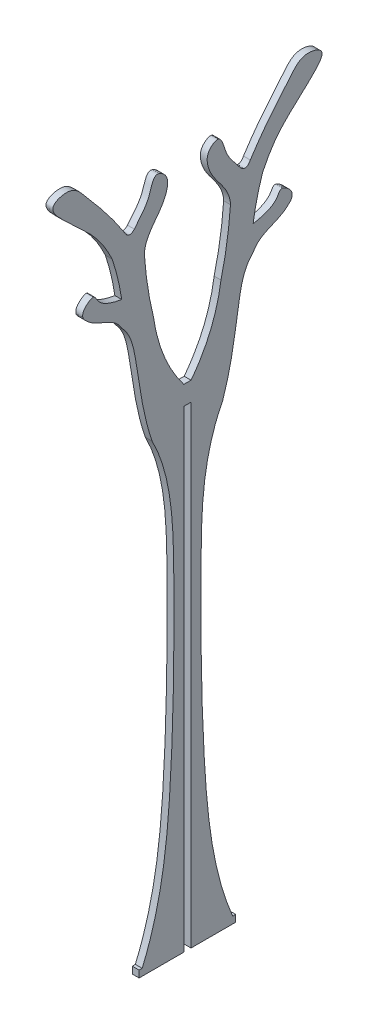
ISO-10303-21;
HEADER;
FILE_DESCRIPTION(('STEP AP214'),'2;1');
FILE_NAME('part.step','',(''),(''),'','','');
FILE_SCHEMA(('AUTOMOTIVE_DESIGN { 1 0 10303 214 1 1 1 1 }'));
ENDSEC;
DATA;
#1=APPLICATION_CONTEXT('core data for automotive mechanical design processes');
#2=APPLICATION_PROTOCOL_DEFINITION('international standard','automotive_design',2000,#1);
#3=PRODUCT_CONTEXT('',#1,'mechanical');
#4=PRODUCT('Part','Part','',(#3));
#5=PRODUCT_RELATED_PRODUCT_CATEGORY('part','',(#4));
#6=PRODUCT_DEFINITION_FORMATION('','',#4);
#7=PRODUCT_DEFINITION_CONTEXT('part definition',#1,'design');
#8=PRODUCT_DEFINITION('design','',#6,#7);
#9=PRODUCT_DEFINITION_SHAPE('','',#8);
#10=(LENGTH_UNIT() NAMED_UNIT(*) SI_UNIT(.MILLI.,.METRE.));
#11=(NAMED_UNIT(*) PLANE_ANGLE_UNIT() SI_UNIT($,.RADIAN.));
#12=(NAMED_UNIT(*) SI_UNIT($,.STERADIAN.) SOLID_ANGLE_UNIT());
#13=UNCERTAINTY_MEASURE_WITH_UNIT(LENGTH_MEASURE(1.E-05),#10,'distance_accuracy_value','');
#14=(GEOMETRIC_REPRESENTATION_CONTEXT(3) GLOBAL_UNCERTAINTY_ASSIGNED_CONTEXT((#13)) GLOBAL_UNIT_ASSIGNED_CONTEXT((#10,
#11,#12)) REPRESENTATION_CONTEXT('',''));
#15=CARTESIAN_POINT('',(0.,0.,0.));
#16=DIRECTION('',(0.,0.,1.));
#17=DIRECTION('',(1.,0.,0.));
#18=AXIS2_PLACEMENT_3D('',#15,#16,#17);
#19=CARTESIAN_POINT('',(18.,-102.065063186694,348.327513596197));
#20=DIRECTION('',(0.,-1.,2.81755677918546E-12));
#21=DIRECTION('',(0.,-2.81755677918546E-12,-1.));
#22=AXIS2_PLACEMENT_3D('',#19,#20,#21);
#23=PLANE('',#22);
#24=DIRECTION('',(0.,2.81755677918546E-12,1.));
#25=VECTOR('',#24,1.);
#26=CARTESIAN_POINT('',(0.,-102.065063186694,348.327513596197));
#27=LINE('',#26,#25);
#28=CARTESIAN_POINT('',(0.,-102.065063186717,340.328552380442));
#29=VERTEX_POINT('',#28);
#30=CARTESIAN_POINT('',(0.,-102.065063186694,348.327513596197));
#31=VERTEX_POINT('',#30);
#32=EDGE_CURVE('E260',#29,#31,#27,.T.);
#33=ORIENTED_EDGE('',*,*,#32,.T.);
#34=DIRECTION('',(-1.,0.,0.));
#35=VECTOR('',#34,1.);
#36=CARTESIAN_POINT('',(18.,-102.065063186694,348.327513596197));
#37=LINE('',#36,#35);
#38=CARTESIAN_POINT('',(18.,-102.065063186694,348.327513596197));
#39=VERTEX_POINT('',#38);
#40=EDGE_CURVE('E11',#39,#31,#37,.T.);
#41=ORIENTED_EDGE('',*,*,#40,.F.);
#42=DIRECTION('',(0.,2.81755677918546E-12,1.));
#43=VECTOR('',#42,1.);
#44=CARTESIAN_POINT('',(18.,-102.065063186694,348.327513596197));
#45=LINE('',#44,#43);
#46=CARTESIAN_POINT('',(18.,-102.065063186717,340.328552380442));
#47=VERTEX_POINT('',#46);
#48=EDGE_CURVE('E418',#47,#39,#45,.T.);
#49=ORIENTED_EDGE('',*,*,#48,.F.);
#50=DIRECTION('',(-1.,0.,0.));
#51=VECTOR('',#50,1.);
#52=CARTESIAN_POINT('',(18.,-102.065063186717,340.328552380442));
#53=LINE('',#52,#51);
#54=EDGE_CURVE('E256',#47,#29,#53,.T.);
#55=ORIENTED_EDGE('',*,*,#54,.T.);
#56=EDGE_LOOP('',(#33,#41,#49,#55));
#57=FACE_BOUND('',#56,.T.);
#58=ADVANCED_FACE('F32',(#57),#23,.F.);
#59=CARTESIAN_POINT('',(18.,-102.065063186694,348.327513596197));
#60=CARTESIAN_POINT('',(18.,-50.3471989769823,370.406574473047));
#61=CARTESIAN_POINT('',(18.,77.3533615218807,406.758439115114));
#62=CARTESIAN_POINT('',(18.,362.214519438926,430.841066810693));
#63=CARTESIAN_POINT('',(18.,703.166417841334,433.488963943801));
#64=CARTESIAN_POINT('',(18.,980.40872740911,428.763865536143));
#65=CARTESIAN_POINT('',(18.,1085.29034068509,374.416732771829));
#66=B_SPLINE_CURVE_WITH_KNOTS('',3,(#59,#60,#61,#62,#63,#64,#65),.UNSPECIFIED.,.F.,.F.,(4,1,1,1,
4),(0.,0.136622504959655,0.325866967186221,0.696865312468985,0.984083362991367),.UNSPECIFIED.);
#67=DIRECTION('',(-1.,0.,0.));
#68=VECTOR('',#67,1.);
#69=SURFACE_OF_LINEAR_EXTRUSION('',#66,#68);
#70=CARTESIAN_POINT('',(0.,-102.065063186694,348.327513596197));
#71=CARTESIAN_POINT('',(0.,-50.3471989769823,370.406574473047));
#72=CARTESIAN_POINT('',(0.,77.3533615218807,406.758439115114));
#73=CARTESIAN_POINT('',(0.,362.214519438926,430.841066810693));
#74=CARTESIAN_POINT('',(0.,703.166417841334,433.488963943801));
#75=CARTESIAN_POINT('',(0.,980.40872740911,428.763865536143));
#76=CARTESIAN_POINT('',(0.,1085.29034068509,374.416732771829));
#77=B_SPLINE_CURVE_WITH_KNOTS('',3,(#70,#71,#72,#73,#74,#75,#76),.UNSPECIFIED.,.F.,.F.,(4,1,1,1,
4),(0.,0.136622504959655,0.325866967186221,0.696865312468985,0.984083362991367),.UNSPECIFIED.);
#78=CARTESIAN_POINT('',(0.,1085.29034068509,374.416732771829));
#79=VERTEX_POINT('',#78);
#80=EDGE_CURVE('E263',#31,#79,#77,.T.);
#81=ORIENTED_EDGE('',*,*,#80,.T.);
#82=DIRECTION('',(-1.,0.,0.));
#83=VECTOR('',#82,1.);
#84=CARTESIAN_POINT('',(18.,1085.29034068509,374.416732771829));
#85=LINE('',#84,#83);
#86=CARTESIAN_POINT('',(18.,1085.29034068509,374.416732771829));
#87=VERTEX_POINT('',#86);
#88=EDGE_CURVE('E40',#87,#79,#85,.T.);
#89=ORIENTED_EDGE('',*,*,#88,.F.);
#90=EDGE_CURVE('E157',#39,#87,#66,.T.);
#91=ORIENTED_EDGE('',*,*,#90,.F.);
#92=ORIENTED_EDGE('',*,*,#40,.T.);
#93=EDGE_LOOP('',(#81,#89,#91,#92));
#94=FACE_BOUND('',#93,.T.);
#95=ADVANCED_FACE('F545',(#94),#69,.F.);
#96=CARTESIAN_POINT('',(18.,1085.29034068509,374.416732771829));
#97=CARTESIAN_POINT('',(18.,1122.39012110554,361.752567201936));
#98=CARTESIAN_POINT('',(18.,1194.30701632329,345.048249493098));
#99=CARTESIAN_POINT('',(18.,1296.67266670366,332.104046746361));
#100=CARTESIAN_POINT('',(18.,1359.36695551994,317.215444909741));
#101=CARTESIAN_POINT('',(18.,1382.19578894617,294.569377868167));
#102=B_SPLINE_CURVE_WITH_KNOTS('',3,(#96,#97,#98,#99,#100,#101),.UNSPECIFIED.,.F.,.F.,(4,1,1,4),
(0.,0.379260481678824,0.713287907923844,1.),.UNSPECIFIED.);
#103=DIRECTION('',(-1.,0.,0.));
#104=VECTOR('',#103,1.);
#105=SURFACE_OF_LINEAR_EXTRUSION('',#102,#104);
#106=CARTESIAN_POINT('',(0.,1085.29034068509,374.416732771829));
#107=CARTESIAN_POINT('',(0.,1122.39012110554,361.752567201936));
#108=CARTESIAN_POINT('',(0.,1194.30701632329,345.048249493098));
#109=CARTESIAN_POINT('',(0.,1296.67266670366,332.104046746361));
#110=CARTESIAN_POINT('',(0.,1359.36695551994,317.215444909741));
#111=CARTESIAN_POINT('',(0.,1382.19578894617,294.569377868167));
#112=B_SPLINE_CURVE_WITH_KNOTS('',3,(#106,#107,#108,#109,#110,#111),.UNSPECIFIED.,.F.,.F.,(4,1,
1,4),(0.,0.379260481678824,0.713287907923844,1.),.UNSPECIFIED.);
#113=CARTESIAN_POINT('',(0.,1382.19578894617,294.569377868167));
#114=VERTEX_POINT('',#113);
#115=EDGE_CURVE('E267',#79,#114,#112,.T.);
#116=ORIENTED_EDGE('',*,*,#115,.T.);
#117=DIRECTION('',(-1.,0.,0.));
#118=VECTOR('',#117,1.);
#119=CARTESIAN_POINT('',(18.,1382.19578894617,294.569377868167));
#120=LINE('',#119,#118);
#121=CARTESIAN_POINT('',(18.,1382.19578894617,294.569377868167));
#122=VERTEX_POINT('',#121);
#123=EDGE_CURVE('E491',#122,#114,#120,.T.);
#124=ORIENTED_EDGE('',*,*,#123,.F.);
#125=EDGE_CURVE('E499',#87,#122,#102,.T.);
#126=ORIENTED_EDGE('',*,*,#125,.F.);
#127=ORIENTED_EDGE('',*,*,#88,.T.);
#128=EDGE_LOOP('',(#116,#124,#126,#127));
#129=FACE_BOUND('',#128,.T.);
#130=ADVANCED_FACE('F497',(#129),#105,.F.);
#131=CARTESIAN_POINT('',(18.,1382.19578894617,294.569377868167));
#132=CARTESIAN_POINT('',(18.,1418.99586689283,275.310990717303));
#133=CARTESIAN_POINT('',(18.,1417.17916799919,228.746989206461));
#134=CARTESIAN_POINT('',(18.,1445.09122585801,201.939813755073));
#135=B_SPLINE_CURVE_WITH_KNOTS('',3,(#131,#132,#133,#134),.UNSPECIFIED.,.F.,.F.,(4,4),(0.,1.),.UNSPECIFIED.);
#136=DIRECTION('',(-1.,0.,0.));
#137=VECTOR('',#136,1.);
#138=SURFACE_OF_LINEAR_EXTRUSION('',#135,#137);
#139=CARTESIAN_POINT('',(0.,1382.19578894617,294.569377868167));
#140=CARTESIAN_POINT('',(0.,1418.99586689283,275.310990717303));
#141=CARTESIAN_POINT('',(0.,1417.17916799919,228.746989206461));
#142=CARTESIAN_POINT('',(0.,1445.09122585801,201.939813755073));
#143=B_SPLINE_CURVE_WITH_KNOTS('',3,(#139,#140,#141,#142),.UNSPECIFIED.,.F.,.F.,(4,4),(0.,1.),.UNSPECIFIED.);
#144=CARTESIAN_POINT('',(0.,1445.09122585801,201.939813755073));
#145=VERTEX_POINT('',#144);
#146=EDGE_CURVE('E274',#114,#145,#143,.T.);
#147=ORIENTED_EDGE('',*,*,#146,.T.);
#148=DIRECTION('',(-1.,0.,0.));
#149=VECTOR('',#148,1.);
#150=CARTESIAN_POINT('',(18.,1445.09122585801,201.939813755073));
#151=LINE('',#150,#149);
#152=CARTESIAN_POINT('',(18.,1445.09122585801,201.939813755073));
#153=VERTEX_POINT('',#152);
#154=EDGE_CURVE('E488',#153,#145,#151,.T.);
#155=ORIENTED_EDGE('',*,*,#154,.F.);
#156=EDGE_CURVE('E517',#122,#153,#135,.T.);
#157=ORIENTED_EDGE('',*,*,#156,.F.);
#158=ORIENTED_EDGE('',*,*,#123,.T.);
#159=EDGE_LOOP('',(#147,#155,#157,#158));
#160=FACE_BOUND('',#159,.T.);
#161=ADVANCED_FACE('F508',(#160),#138,.F.);
#162=CARTESIAN_POINT('',(18.,1445.09122585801,201.939813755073));
#163=CARTESIAN_POINT('',(18.,1459.20417597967,182.916466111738));
#164=CARTESIAN_POINT('',(18.,1480.59158930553,195.762265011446));
#165=CARTESIAN_POINT('',(18.,1493.51988707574,223.101636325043));
#166=CARTESIAN_POINT('',(18.,1475.0719689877,230.565968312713));
#167=CARTESIAN_POINT('',(18.,1456.4606147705,252.114591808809));
#168=CARTESIAN_POINT('',(18.,1450.45765615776,277.468960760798));
#169=CARTESIAN_POINT('',(18.,1447.52556976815,294.569377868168));
#170=B_SPLINE_CURVE_WITH_KNOTS('',3,(#162,#163,#164,#165,#166,#167,#168,#169),.UNSPECIFIED.,.F.,
.F.,(4,1,1,1,1,4),(0.,0.336795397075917,0.409108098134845,0.52118844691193,0.643455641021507,
1.),.UNSPECIFIED.);
#171=DIRECTION('',(-1.,0.,0.));
#172=VECTOR('',#171,1.);
#173=SURFACE_OF_LINEAR_EXTRUSION('',#170,#172);
#174=CARTESIAN_POINT('',(0.,1445.09122585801,201.939813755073));
#175=CARTESIAN_POINT('',(0.,1459.20417597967,182.916466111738));
#176=CARTESIAN_POINT('',(0.,1480.59158930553,195.762265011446));
#177=CARTESIAN_POINT('',(0.,1493.51988707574,223.101636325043));
#178=CARTESIAN_POINT('',(0.,1475.0719689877,230.565968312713));
#179=CARTESIAN_POINT('',(0.,1456.4606147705,252.114591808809));
#180=CARTESIAN_POINT('',(0.,1450.45765615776,277.468960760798));
#181=CARTESIAN_POINT('',(0.,1447.52556976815,294.569377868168));
#182=B_SPLINE_CURVE_WITH_KNOTS('',3,(#174,#175,#176,#177,#178,#179,#180,#181),.UNSPECIFIED.,.F.,
.F.,(4,1,1,1,1,4),(0.,0.336795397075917,0.409108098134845,0.52118844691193,0.643455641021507,
1.),.UNSPECIFIED.);
#183=CARTESIAN_POINT('',(0.,1447.52556976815,294.569377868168));
#184=VERTEX_POINT('',#183);
#185=EDGE_CURVE('E281',#145,#184,#182,.T.);
#186=ORIENTED_EDGE('',*,*,#185,.T.);
#187=DIRECTION('',(-1.,0.,0.));
#188=VECTOR('',#187,1.);
#189=CARTESIAN_POINT('',(18.,1447.52556976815,294.569377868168));
#190=LINE('',#189,#188);
#191=CARTESIAN_POINT('',(18.,1447.52556976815,294.569377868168));
#192=VERTEX_POINT('',#191);
#193=EDGE_CURVE('E485',#192,#184,#190,.T.);
#194=ORIENTED_EDGE('',*,*,#193,.F.);
#195=EDGE_CURVE('E514',#153,#192,#170,.T.);
#196=ORIENTED_EDGE('',*,*,#195,.F.);
#197=ORIENTED_EDGE('',*,*,#154,.T.);
#198=EDGE_LOOP('',(#186,#194,#196,#197));
#199=FACE_BOUND('',#198,.T.);
#200=ADVANCED_FACE('F512',(#199),#173,.F.);
#201=CARTESIAN_POINT('',(18.,1447.52556976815,294.569377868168));
#202=CARTESIAN_POINT('',(18.,1500.79321353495,286.733849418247));
#203=CARTESIAN_POINT('',(18.,1551.90531483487,269.555985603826));
#204=B_SPLINE_CURVE_WITH_KNOTS('',2,(#201,#202,#203),.UNSPECIFIED.,.F.,.F.,(3,3),(0.,1.),.UNSPECIFIED.);
#205=DIRECTION('',(-1.,0.,0.));
#206=VECTOR('',#205,1.);
#207=SURFACE_OF_LINEAR_EXTRUSION('',#204,#206);
#208=CARTESIAN_POINT('',(0.,1447.52556976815,294.569377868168));
#209=CARTESIAN_POINT('',(0.,1500.79321353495,286.733849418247));
#210=CARTESIAN_POINT('',(0.,1551.90531483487,269.555985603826));
#211=B_SPLINE_CURVE_WITH_KNOTS('',2,(#208,#209,#210),.UNSPECIFIED.,.F.,.F.,(3,3),(0.,1.),.UNSPECIFIED.);
#212=CARTESIAN_POINT('',(0.,1551.90531483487,269.555985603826));
#213=VERTEX_POINT('',#212);
#214=EDGE_CURVE('E288',#184,#213,#211,.T.);
#215=ORIENTED_EDGE('',*,*,#214,.T.);
#216=DIRECTION('',(-1.,0.,0.));
#217=VECTOR('',#216,1.);
#218=CARTESIAN_POINT('',(18.,1551.90531483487,269.555985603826));
#219=LINE('',#218,#217);
#220=CARTESIAN_POINT('',(18.,1551.90531483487,269.555985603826));
#221=VERTEX_POINT('',#220);
#222=EDGE_CURVE('E482',#221,#213,#219,.T.);
#223=ORIENTED_EDGE('',*,*,#222,.F.);
#224=EDGE_CURVE('E516',#192,#221,#204,.T.);
#225=ORIENTED_EDGE('',*,*,#224,.F.);
#226=ORIENTED_EDGE('',*,*,#193,.T.);
#227=EDGE_LOOP('',(#215,#223,#225,#226));
#228=FACE_BOUND('',#227,.T.);
#229=ADVANCED_FACE('F540',(#228),#207,.F.);
#230=CARTESIAN_POINT('',(18.,1551.90531483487,269.555985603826));
#231=CARTESIAN_POINT('',(18.,1630.14427168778,232.350307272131));
#232=CARTESIAN_POINT('',(18.,1651.42055410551,191.889125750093));
#233=CARTESIAN_POINT('',(18.,1752.33880535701,94.3066784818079));
#234=CARTESIAN_POINT('',(18.,1769.3588344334,154.29066282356));
#235=CARTESIAN_POINT('',(18.,1751.89031157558,181.75675813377));
#236=CARTESIAN_POINT('',(18.,1720.87794995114,205.90726024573));
#237=CARTESIAN_POINT('',(18.,1672.39537245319,249.189179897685));
#238=CARTESIAN_POINT('',(18.,1625.94983213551,282.701001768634));
#239=CARTESIAN_POINT('',(18.,1596.3007384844,301.940349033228));
#240=B_SPLINE_CURVE_WITH_KNOTS('',3,(#230,#231,#232,#233,#234,#235,#236,#237,#238,#239),
.UNSPECIFIED.,.F.,.F.,(4,1,1,1,1,1,1,4),(0.,0.385763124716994,0.485334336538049,
0.571206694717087,0.624037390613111,0.671733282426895,0.795732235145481,1.),.UNSPECIFIED.);
#241=DIRECTION('',(-1.,0.,0.));
#242=VECTOR('',#241,1.);
#243=SURFACE_OF_LINEAR_EXTRUSION('',#240,#242);
#244=CARTESIAN_POINT('',(0.,1551.90531483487,269.555985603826));
#245=CARTESIAN_POINT('',(0.,1630.14427168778,232.350307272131));
#246=CARTESIAN_POINT('',(0.,1651.42055410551,191.889125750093));
#247=CARTESIAN_POINT('',(0.,1752.33880535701,94.3066784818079));
#248=CARTESIAN_POINT('',(0.,1769.3588344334,154.29066282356));
#249=CARTESIAN_POINT('',(0.,1751.89031157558,181.75675813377));
#250=CARTESIAN_POINT('',(0.,1720.87794995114,205.90726024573));
#251=CARTESIAN_POINT('',(0.,1672.39537245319,249.189179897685));
#252=CARTESIAN_POINT('',(0.,1625.94983213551,282.701001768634));
#253=CARTESIAN_POINT('',(0.,1596.3007384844,301.940349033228));
#254=B_SPLINE_CURVE_WITH_KNOTS('',3,(#244,#245,#246,#247,#248,#249,#250,#251,#252,#253),
.UNSPECIFIED.,.F.,.F.,(4,1,1,1,1,1,1,4),(0.,0.385763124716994,0.485334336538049,
0.571206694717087,0.624037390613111,0.671733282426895,0.795732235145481,1.),.UNSPECIFIED.);
#255=CARTESIAN_POINT('',(0.,1596.3007384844,301.940349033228));
#256=VERTEX_POINT('',#255);
#257=EDGE_CURVE('E295',#213,#256,#254,.T.);
#258=ORIENTED_EDGE('',*,*,#257,.T.);
#259=DIRECTION('',(-1.,0.,0.));
#260=VECTOR('',#259,1.);
#261=CARTESIAN_POINT('',(18.,1596.3007384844,301.940349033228));
#262=LINE('',#261,#260);
#263=CARTESIAN_POINT('',(18.,1596.3007384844,301.940349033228));
#264=VERTEX_POINT('',#263);
#265=EDGE_CURVE('E479',#264,#256,#262,.T.);
#266=ORIENTED_EDGE('',*,*,#265,.F.);
#267=EDGE_CURVE('E519',#221,#264,#240,.T.);
#268=ORIENTED_EDGE('',*,*,#267,.F.);
#269=ORIENTED_EDGE('',*,*,#222,.T.);
#270=EDGE_LOOP('',(#258,#266,#268,#269));
#271=FACE_BOUND('',#270,.T.);
#272=ADVANCED_FACE('F600',(#271),#243,.F.);
#273=CARTESIAN_POINT('',(18.,1596.3007384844,301.940349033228));
#274=CARTESIAN_POINT('',(18.,1576.2379498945,312.750016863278));
#275=CARTESIAN_POINT('',(18.,1591.22762554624,327.745318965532));
#276=B_SPLINE_CURVE_WITH_KNOTS('',2,(#273,#274,#275),.UNSPECIFIED.,.F.,.F.,(3,3),(0.,1.),.UNSPECIFIED.);
#277=DIRECTION('',(-1.,0.,0.));
#278=VECTOR('',#277,1.);
#279=SURFACE_OF_LINEAR_EXTRUSION('',#276,#278);
#280=CARTESIAN_POINT('',(0.,1596.3007384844,301.940349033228));
#281=CARTESIAN_POINT('',(0.,1576.2379498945,312.750016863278));
#282=CARTESIAN_POINT('',(0.,1591.22762554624,327.745318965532));
#283=B_SPLINE_CURVE_WITH_KNOTS('',2,(#280,#281,#282),.UNSPECIFIED.,.F.,.F.,(3,3),(0.,1.),.UNSPECIFIED.);
#284=CARTESIAN_POINT('',(0.,1591.22762554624,327.745318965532));
#285=VERTEX_POINT('',#284);
#286=EDGE_CURVE('E302',#256,#285,#283,.T.);
#287=ORIENTED_EDGE('',*,*,#286,.T.);
#288=DIRECTION('',(-1.,0.,0.));
#289=VECTOR('',#288,1.);
#290=CARTESIAN_POINT('',(18.,1591.22762554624,327.745318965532));
#291=LINE('',#290,#289);
#292=CARTESIAN_POINT('',(18.,1591.22762554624,327.745318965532));
#293=VERTEX_POINT('',#292);
#294=EDGE_CURVE('E476',#293,#285,#291,.T.);
#295=ORIENTED_EDGE('',*,*,#294,.F.);
#296=EDGE_CURVE('E945',#264,#293,#276,.T.);
#297=ORIENTED_EDGE('',*,*,#296,.F.);
#298=ORIENTED_EDGE('',*,*,#265,.T.);
#299=EDGE_LOOP('',(#287,#295,#297,#298));
#300=FACE_BOUND('',#299,.T.);
#301=ADVANCED_FACE('F609',(#300),#279,.F.);
#302=CARTESIAN_POINT('',(18.,1591.22762554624,327.745318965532));
#303=CARTESIAN_POINT('',(18.,1619.17927999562,349.424359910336));
#304=CARTESIAN_POINT('',(18.,1632.74059074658,365.07903383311));
#305=CARTESIAN_POINT('',(18.,1696.40785667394,380.115557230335));
#306=CARTESIAN_POINT('',(18.,1672.97152257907,415.375831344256));
#307=CARTESIAN_POINT('',(18.,1648.96332136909,416.129467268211));
#308=CARTESIAN_POINT('',(18.,1628.39450218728,410.70244728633));
#309=CARTESIAN_POINT('',(18.,1601.98611846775,398.088276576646));
#310=CARTESIAN_POINT('',(18.,1570.58418902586,369.94017482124));
#311=CARTESIAN_POINT('',(18.,1538.73634635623,354.52061175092));
#312=CARTESIAN_POINT('',(18.,1520.55759534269,354.085962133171));
#313=B_SPLINE_CURVE_WITH_KNOTS('',3,(#302,#303,#304,#305,#306,#307,#308,#309,#310,#311,#312),
.UNSPECIFIED.,.F.,.F.,(4,1,1,1,1,1,1,1,4),(0.,0.252302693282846,0.363690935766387,
0.456026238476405,0.541932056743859,0.588618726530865,0.664111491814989,0.825410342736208,1.),.UNSPECIFIED.);
#314=DIRECTION('',(-1.,0.,0.));
#315=VECTOR('',#314,1.);
#316=SURFACE_OF_LINEAR_EXTRUSION('',#313,#315);
#317=CARTESIAN_POINT('',(0.,1591.22762554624,327.745318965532));
#318=CARTESIAN_POINT('',(0.,1619.17927999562,349.424359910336));
#319=CARTESIAN_POINT('',(0.,1632.74059074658,365.07903383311));
#320=CARTESIAN_POINT('',(0.,1696.40785667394,380.115557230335));
#321=CARTESIAN_POINT('',(0.,1672.97152257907,415.375831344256));
#322=CARTESIAN_POINT('',(0.,1648.96332136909,416.129467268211));
#323=CARTESIAN_POINT('',(0.,1628.39450218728,410.70244728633));
#324=CARTESIAN_POINT('',(0.,1601.98611846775,398.088276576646));
#325=CARTESIAN_POINT('',(0.,1570.58418902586,369.94017482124));
#326=CARTESIAN_POINT('',(0.,1538.73634635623,354.52061175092));
#327=CARTESIAN_POINT('',(0.,1520.55759534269,354.085962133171));
#328=B_SPLINE_CURVE_WITH_KNOTS('',3,(#317,#318,#319,#320,#321,#322,#323,#324,#325,#326,#327),
.UNSPECIFIED.,.F.,.F.,(4,1,1,1,1,1,1,1,4),(0.,0.252302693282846,0.363690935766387,
0.456026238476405,0.541932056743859,0.588618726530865,0.664111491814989,0.825410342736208,1.),.UNSPECIFIED.);
#329=CARTESIAN_POINT('',(0.,1520.55759534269,354.085962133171));
#330=VERTEX_POINT('',#329);
#331=EDGE_CURVE('E309',#285,#330,#328,.T.);
#332=ORIENTED_EDGE('',*,*,#331,.T.);
#333=DIRECTION('',(-1.,0.,0.));
#334=VECTOR('',#333,1.);
#335=CARTESIAN_POINT('',(18.,1520.55759534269,354.085962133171));
#336=LINE('',#335,#334);
#337=CARTESIAN_POINT('',(18.,1520.55759534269,354.085962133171));
#338=VERTEX_POINT('',#337);
#339=EDGE_CURVE('E473',#338,#330,#336,.T.);
#340=ORIENTED_EDGE('',*,*,#339,.F.);
#341=EDGE_CURVE('E942',#293,#338,#313,.T.);
#342=ORIENTED_EDGE('',*,*,#341,.F.);
#343=ORIENTED_EDGE('',*,*,#294,.T.);
#344=EDGE_LOOP('',(#332,#340,#342,#343));
#345=FACE_BOUND('',#344,.T.);
#346=ADVANCED_FACE('F618',(#345),#316,.F.);
#347=CARTESIAN_POINT('',(18.,1520.55759534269,354.085962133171));
#348=CARTESIAN_POINT('',(18.,1440.05033038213,359.632506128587));
#349=CARTESIAN_POINT('',(18.,1361.52525284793,379.003516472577));
#350=B_SPLINE_CURVE_WITH_KNOTS('',2,(#347,#348,#349),.UNSPECIFIED.,.F.,.F.,(3,3),(0.,1.),.UNSPECIFIED.);
#351=DIRECTION('',(-1.,0.,0.));
#352=VECTOR('',#351,1.);
#353=SURFACE_OF_LINEAR_EXTRUSION('',#350,#352);
#354=CARTESIAN_POINT('',(0.,1520.55759534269,354.085962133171));
#355=CARTESIAN_POINT('',(0.,1440.05033038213,359.632506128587));
#356=CARTESIAN_POINT('',(0.,1361.52525284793,379.003516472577));
#357=B_SPLINE_CURVE_WITH_KNOTS('',2,(#354,#355,#356),.UNSPECIFIED.,.F.,.F.,(3,3),(0.,1.),.UNSPECIFIED.);
#358=CARTESIAN_POINT('',(0.,1361.52525284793,379.003516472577));
#359=VERTEX_POINT('',#358);
#360=EDGE_CURVE('E316',#330,#359,#357,.T.);
#361=ORIENTED_EDGE('',*,*,#360,.T.);
#362=DIRECTION('',(-1.,0.,0.));
#363=VECTOR('',#362,1.);
#364=CARTESIAN_POINT('',(18.,1361.52525284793,379.003516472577));
#365=LINE('',#364,#363);
#366=CARTESIAN_POINT('',(18.,1361.52525284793,379.003516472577));
#367=VERTEX_POINT('',#366);
#368=EDGE_CURVE('E470',#367,#359,#365,.T.);
#369=ORIENTED_EDGE('',*,*,#368,.F.);
#370=EDGE_CURVE('E940',#338,#367,#350,.T.);
#371=ORIENTED_EDGE('',*,*,#370,.F.);
#372=ORIENTED_EDGE('',*,*,#339,.T.);
#373=EDGE_LOOP('',(#361,#369,#371,#372));
#374=FACE_BOUND('',#373,.T.);
#375=ADVANCED_FACE('F628',(#374),#353,.F.);
#376=CARTESIAN_POINT('',(18.,1361.52525284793,379.003516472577));
#377=CARTESIAN_POINT('',(18.,1255.1269074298,394.540775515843));
#378=CARTESIAN_POINT('',(18.,1172.78017855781,457.786070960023));
#379=B_SPLINE_CURVE_WITH_KNOTS('',2,(#376,#377,#378),.UNSPECIFIED.,.F.,.F.,(3,3),(0.,1.),.UNSPECIFIED.);
#380=DIRECTION('',(-1.,0.,0.));
#381=VECTOR('',#380,1.);
#382=SURFACE_OF_LINEAR_EXTRUSION('',#379,#381);
#383=CARTESIAN_POINT('',(0.,1361.52525284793,379.003516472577));
#384=CARTESIAN_POINT('',(0.,1255.1269074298,394.540775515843));
#385=CARTESIAN_POINT('',(0.,1172.78017855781,457.786070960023));
#386=B_SPLINE_CURVE_WITH_KNOTS('',2,(#383,#384,#385),.UNSPECIFIED.,.F.,.F.,(3,3),(0.,1.),.UNSPECIFIED.);
#387=CARTESIAN_POINT('',(0.,1172.78017855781,457.786070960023));
#388=VERTEX_POINT('',#387);
#389=EDGE_CURVE('E323',#359,#388,#386,.T.);
#390=ORIENTED_EDGE('',*,*,#389,.T.);
#391=DIRECTION('',(-1.,0.,0.));
#392=VECTOR('',#391,1.);
#393=CARTESIAN_POINT('',(18.,1172.78017855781,457.786070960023));
#394=LINE('',#393,#392);
#395=CARTESIAN_POINT('',(18.,1172.78017855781,457.786070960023));
#396=VERTEX_POINT('',#395);
#397=EDGE_CURVE('E467',#396,#388,#394,.T.);
#398=ORIENTED_EDGE('',*,*,#397,.F.);
#399=EDGE_CURVE('E933',#367,#396,#379,.T.);
#400=ORIENTED_EDGE('',*,*,#399,.F.);
#401=ORIENTED_EDGE('',*,*,#368,.T.);
#402=EDGE_LOOP('',(#390,#398,#400,#401));
#403=FACE_BOUND('',#402,.T.);
#404=ADVANCED_FACE('F638',(#403),#382,.F.);
#405=CARTESIAN_POINT('',(18.,1172.78017855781,457.786070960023));
#406=DIRECTION('',(0.,-1.,0.));
#407=DIRECTION('',(0.,0.,-1.));
#408=AXIS2_PLACEMENT_3D('',#405,#406,#407);
#409=PLANE('',#408);
#410=DIRECTION('',(0.,0.,1.));
#411=VECTOR('',#410,1.);
#412=CARTESIAN_POINT('',(0.,1172.78017855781,457.786070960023));
#413=LINE('',#412,#411);
#414=CARTESIAN_POINT('',(0.,1172.78017855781,476.786070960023));
#415=VERTEX_POINT('',#414);
#416=EDGE_CURVE('E330',#388,#415,#413,.T.);
#417=ORIENTED_EDGE('',*,*,#416,.T.);
#418=DIRECTION('',(-1.,0.,0.));
#419=VECTOR('',#418,1.);
#420=CARTESIAN_POINT('',(18.,1172.78017855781,476.786070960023));
#421=LINE('',#420,#419);
#422=CARTESIAN_POINT('',(18.,1172.78017855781,476.786070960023));
#423=VERTEX_POINT('',#422);
#424=EDGE_CURVE('E464',#423,#415,#421,.T.);
#425=ORIENTED_EDGE('',*,*,#424,.F.);
#426=DIRECTION('',(0.,0.,1.));
#427=VECTOR('',#426,1.);
#428=CARTESIAN_POINT('',(18.,1172.78017855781,457.786070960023));
#429=LINE('',#428,#427);
#430=EDGE_CURVE('E930',#396,#423,#429,.T.);
#431=ORIENTED_EDGE('',*,*,#430,.F.);
#432=ORIENTED_EDGE('',*,*,#397,.T.);
#433=EDGE_LOOP('',(#417,#425,#431,#432));
#434=FACE_BOUND('',#433,.T.);
#435=ADVANCED_FACE('F648',(#434),#409,.F.);
#436=CARTESIAN_POINT('',(18.,1172.78017855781,476.786070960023));
#437=CARTESIAN_POINT('',(18.,1255.1269074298,540.031366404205));
#438=CARTESIAN_POINT('',(18.,1361.52525284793,555.568625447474));
#439=B_SPLINE_CURVE_WITH_KNOTS('',2,(#436,#437,#438),.UNSPECIFIED.,.F.,.F.,(3,3),(0.,1.),.UNSPECIFIED.);
#440=DIRECTION('',(-1.,0.,0.));
#441=VECTOR('',#440,1.);
#442=SURFACE_OF_LINEAR_EXTRUSION('',#439,#441);
#443=CARTESIAN_POINT('',(0.,1172.78017855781,476.786070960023));
#444=CARTESIAN_POINT('',(0.,1255.1269074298,540.031366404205));
#445=CARTESIAN_POINT('',(0.,1361.52525284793,555.568625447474));
#446=B_SPLINE_CURVE_WITH_KNOTS('',2,(#443,#444,#445),.UNSPECIFIED.,.F.,.F.,(3,3),(0.,1.),.UNSPECIFIED.);
#447=CARTESIAN_POINT('',(0.,1361.52525284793,555.568625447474));
#448=VERTEX_POINT('',#447);
#449=EDGE_CURVE('E335',#415,#448,#446,.T.);
#450=ORIENTED_EDGE('',*,*,#449,.T.);
#451=DIRECTION('',(-1.,0.,0.));
#452=VECTOR('',#451,1.);
#453=CARTESIAN_POINT('',(18.,1361.52525284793,555.568625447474));
#454=LINE('',#453,#452);
#455=CARTESIAN_POINT('',(18.,1361.52525284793,555.568625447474));
#456=VERTEX_POINT('',#455);
#457=EDGE_CURVE('E461',#456,#448,#454,.T.);
#458=ORIENTED_EDGE('',*,*,#457,.F.);
#459=EDGE_CURVE('E928',#423,#456,#439,.T.);
#460=ORIENTED_EDGE('',*,*,#459,.F.);
#461=ORIENTED_EDGE('',*,*,#424,.T.);
#462=EDGE_LOOP('',(#450,#458,#460,#461));
#463=FACE_BOUND('',#462,.T.);
#464=ADVANCED_FACE('F658',(#463),#442,.F.);
#465=CARTESIAN_POINT('',(18.,1361.52525284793,555.568625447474));
#466=CARTESIAN_POINT('',(18.,1440.05033038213,574.939635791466));
#467=CARTESIAN_POINT('',(18.,1520.55759534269,580.486179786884));
#468=B_SPLINE_CURVE_WITH_KNOTS('',2,(#465,#466,#467),.UNSPECIFIED.,.F.,.F.,(3,3),(0.,1.),.UNSPECIFIED.);
#469=DIRECTION('',(-1.,0.,0.));
#470=VECTOR('',#469,1.);
#471=SURFACE_OF_LINEAR_EXTRUSION('',#468,#470);
#472=CARTESIAN_POINT('',(0.,1361.52525284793,555.568625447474));
#473=CARTESIAN_POINT('',(0.,1440.05033038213,574.939635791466));
#474=CARTESIAN_POINT('',(0.,1520.55759534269,580.486179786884));
#475=B_SPLINE_CURVE_WITH_KNOTS('',2,(#472,#473,#474),.UNSPECIFIED.,.F.,.F.,(3,3),(0.,1.),.UNSPECIFIED.);
#476=CARTESIAN_POINT('',(0.,1520.55759534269,580.486179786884));
#477=VERTEX_POINT('',#476);
#478=EDGE_CURVE('E339',#448,#477,#475,.T.);
#479=ORIENTED_EDGE('',*,*,#478,.T.);
#480=DIRECTION('',(-1.,0.,0.));
#481=VECTOR('',#480,1.);
#482=CARTESIAN_POINT('',(18.,1520.55759534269,580.486179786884));
#483=LINE('',#482,#481);
#484=CARTESIAN_POINT('',(18.,1520.55759534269,580.486179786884));
#485=VERTEX_POINT('',#484);
#486=EDGE_CURVE('E458',#485,#477,#483,.T.);
#487=ORIENTED_EDGE('',*,*,#486,.F.);
#488=EDGE_CURVE('E921',#456,#485,#468,.T.);
#489=ORIENTED_EDGE('',*,*,#488,.F.);
#490=ORIENTED_EDGE('',*,*,#457,.T.);
#491=EDGE_LOOP('',(#479,#487,#489,#490));
#492=FACE_BOUND('',#491,.T.);
#493=ADVANCED_FACE('F668',(#492),#471,.F.);
#494=CARTESIAN_POINT('',(18.,1520.55759534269,580.486179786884));
#495=CARTESIAN_POINT('',(18.,1538.73634635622,580.051530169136));
#496=CARTESIAN_POINT('',(18.,1570.58418902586,564.631967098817));
#497=CARTESIAN_POINT('',(18.,1601.98611846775,536.483865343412));
#498=CARTESIAN_POINT('',(18.,1628.39450218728,523.869694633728));
#499=CARTESIAN_POINT('',(18.,1648.96332136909,518.442674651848));
#500=CARTESIAN_POINT('',(18.,1672.97152257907,519.196310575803));
#501=CARTESIAN_POINT('',(18.,1696.40785667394,554.456584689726));
#502=CARTESIAN_POINT('',(18.,1632.74059074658,569.493108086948));
#503=CARTESIAN_POINT('',(18.,1619.17927999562,585.147782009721));
#504=CARTESIAN_POINT('',(18.,1591.22762554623,606.826822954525));
#505=B_SPLINE_CURVE_WITH_KNOTS('',3,(#494,#495,#496,#497,#498,#499,#500,#501,#502,#503,#504),
.UNSPECIFIED.,.F.,.F.,(4,1,1,1,1,1,1,1,4),(0.,0.174589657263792,0.335888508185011,
0.411381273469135,0.458067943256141,0.543973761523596,0.636309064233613,0.747697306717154,1.),.UNSPECIFIED.);
#506=DIRECTION('',(-1.,0.,0.));
#507=VECTOR('',#506,1.);
#508=SURFACE_OF_LINEAR_EXTRUSION('',#505,#507);
#509=CARTESIAN_POINT('',(0.,1520.55759534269,580.486179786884));
#510=CARTESIAN_POINT('',(0.,1538.73634635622,580.051530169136));
#511=CARTESIAN_POINT('',(0.,1570.58418902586,564.631967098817));
#512=CARTESIAN_POINT('',(0.,1601.98611846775,536.483865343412));
#513=CARTESIAN_POINT('',(0.,1628.39450218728,523.869694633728));
#514=CARTESIAN_POINT('',(0.,1648.96332136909,518.442674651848));
#515=CARTESIAN_POINT('',(0.,1672.97152257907,519.196310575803));
#516=CARTESIAN_POINT('',(0.,1696.40785667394,554.456584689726));
#517=CARTESIAN_POINT('',(0.,1632.74059074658,569.493108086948));
#518=CARTESIAN_POINT('',(0.,1619.17927999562,585.147782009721));
#519=CARTESIAN_POINT('',(0.,1591.22762554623,606.826822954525));
#520=B_SPLINE_CURVE_WITH_KNOTS('',3,(#509,#510,#511,#512,#513,#514,#515,#516,#517,#518,#519),
.UNSPECIFIED.,.F.,.F.,(4,1,1,1,1,1,1,1,4),(0.,0.174589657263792,0.335888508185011,
0.411381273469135,0.458067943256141,0.543973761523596,0.636309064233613,0.747697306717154,1.),.UNSPECIFIED.);
#521=CARTESIAN_POINT('',(0.,1591.22762554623,606.826822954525));
#522=VERTEX_POINT('',#521);
#523=EDGE_CURVE('E346',#477,#522,#520,.T.);
#524=ORIENTED_EDGE('',*,*,#523,.T.);
#525=DIRECTION('',(-1.,0.,0.));
#526=VECTOR('',#525,1.);
#527=CARTESIAN_POINT('',(18.,1591.22762554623,606.826822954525));
#528=LINE('',#527,#526);
#529=CARTESIAN_POINT('',(18.,1591.22762554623,606.826822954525));
#530=VERTEX_POINT('',#529);
#531=EDGE_CURVE('E455',#530,#522,#528,.T.);
#532=ORIENTED_EDGE('',*,*,#531,.F.);
#533=EDGE_CURVE('E918',#485,#530,#505,.T.);
#534=ORIENTED_EDGE('',*,*,#533,.F.);
#535=ORIENTED_EDGE('',*,*,#486,.T.);
#536=EDGE_LOOP('',(#524,#532,#534,#535));
#537=FACE_BOUND('',#536,.T.);
#538=ADVANCED_FACE('F678',(#537),#508,.F.);
#539=CARTESIAN_POINT('',(18.,1591.22762554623,606.826822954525));
#540=CARTESIAN_POINT('',(18.,1576.23794989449,621.822125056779));
#541=CARTESIAN_POINT('',(18.,1596.30073848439,632.63179288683));
#542=B_SPLINE_CURVE_WITH_KNOTS('',2,(#539,#540,#541),.UNSPECIFIED.,.F.,.F.,(3,3),(0.,1.),.UNSPECIFIED.);
#543=DIRECTION('',(-1.,0.,0.));
#544=VECTOR('',#543,1.);
#545=SURFACE_OF_LINEAR_EXTRUSION('',#542,#544);
#546=CARTESIAN_POINT('',(0.,1591.22762554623,606.826822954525));
#547=CARTESIAN_POINT('',(0.,1576.23794989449,621.822125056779));
#548=CARTESIAN_POINT('',(0.,1596.30073848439,632.63179288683));
#549=B_SPLINE_CURVE_WITH_KNOTS('',2,(#546,#547,#548),.UNSPECIFIED.,.F.,.F.,(3,3),(0.,1.),.UNSPECIFIED.);
#550=CARTESIAN_POINT('',(0.,1596.30073848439,632.63179288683));
#551=VERTEX_POINT('',#550);
#552=EDGE_CURVE('E353',#522,#551,#549,.T.);
#553=ORIENTED_EDGE('',*,*,#552,.T.);
#554=DIRECTION('',(-1.,0.,0.));
#555=VECTOR('',#554,1.);
#556=CARTESIAN_POINT('',(18.,1596.30073848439,632.63179288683));
#557=LINE('',#556,#555);
#558=CARTESIAN_POINT('',(18.,1596.30073848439,632.63179288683));
#559=VERTEX_POINT('',#558);
#560=EDGE_CURVE('E452',#559,#551,#557,.T.);
#561=ORIENTED_EDGE('',*,*,#560,.F.);
#562=EDGE_CURVE('E916',#530,#559,#542,.T.);
#563=ORIENTED_EDGE('',*,*,#562,.F.);
#564=ORIENTED_EDGE('',*,*,#531,.T.);
#565=EDGE_LOOP('',(#553,#561,#563,#564));
#566=FACE_BOUND('',#565,.T.);
#567=ADVANCED_FACE('F688',(#566),#545,.F.);
#568=CARTESIAN_POINT('',(18.,1596.30073848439,632.63179288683));
#569=CARTESIAN_POINT('',(18.,1625.9498321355,651.871140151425));
#570=CARTESIAN_POINT('',(18.,1672.39537245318,685.382962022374));
#571=CARTESIAN_POINT('',(18.,1720.87794995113,728.664881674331));
#572=CARTESIAN_POINT('',(18.,1751.89031157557,752.815383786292));
#573=CARTESIAN_POINT('',(18.,1769.35883443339,780.281479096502));
#574=CARTESIAN_POINT('',(18.,1752.338805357,840.265463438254));
#575=CARTESIAN_POINT('',(18.,1651.4205541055,742.683016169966));
#576=CARTESIAN_POINT('',(18.,1630.14427168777,702.221834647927));
#577=CARTESIAN_POINT('',(18.,1551.90531483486,665.01615631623));
#578=B_SPLINE_CURVE_WITH_KNOTS('',3,(#568,#569,#570,#571,#572,#573,#574,#575,#576,#577),
.UNSPECIFIED.,.F.,.F.,(4,1,1,1,1,1,1,4),(0.,0.204267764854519,0.328266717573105,
0.375962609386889,0.428793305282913,0.514665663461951,0.614236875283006,1.),.UNSPECIFIED.);
#579=DIRECTION('',(-1.,0.,0.));
#580=VECTOR('',#579,1.);
#581=SURFACE_OF_LINEAR_EXTRUSION('',#578,#580);
#582=CARTESIAN_POINT('',(0.,1596.30073848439,632.63179288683));
#583=CARTESIAN_POINT('',(0.,1625.9498321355,651.871140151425));
#584=CARTESIAN_POINT('',(0.,1672.39537245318,685.382962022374));
#585=CARTESIAN_POINT('',(0.,1720.87794995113,728.664881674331));
#586=CARTESIAN_POINT('',(0.,1751.89031157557,752.815383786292));
#587=CARTESIAN_POINT('',(0.,1769.35883443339,780.281479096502));
#588=CARTESIAN_POINT('',(0.,1752.338805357,840.265463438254));
#589=CARTESIAN_POINT('',(0.,1651.4205541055,742.683016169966));
#590=CARTESIAN_POINT('',(0.,1630.14427168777,702.221834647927));
#591=CARTESIAN_POINT('',(0.,1551.90531483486,665.01615631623));
#592=B_SPLINE_CURVE_WITH_KNOTS('',3,(#582,#583,#584,#585,#586,#587,#588,#589,#590,#591),
.UNSPECIFIED.,.F.,.F.,(4,1,1,1,1,1,1,4),(0.,0.204267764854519,0.328266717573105,
0.375962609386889,0.428793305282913,0.514665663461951,0.614236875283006,1.),.UNSPECIFIED.);
#593=CARTESIAN_POINT('',(0.,1551.90531483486,665.01615631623));
#594=VERTEX_POINT('',#593);
#595=EDGE_CURVE('E360',#551,#594,#592,.T.);
#596=ORIENTED_EDGE('',*,*,#595,.T.);
#597=DIRECTION('',(-1.,0.,0.));
#598=VECTOR('',#597,1.);
#599=CARTESIAN_POINT('',(18.,1551.90531483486,665.01615631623));
#600=LINE('',#599,#598);
#601=CARTESIAN_POINT('',(18.,1551.90531483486,665.01615631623));
#602=VERTEX_POINT('',#601);
#603=EDGE_CURVE('E449',#602,#594,#600,.T.);
#604=ORIENTED_EDGE('',*,*,#603,.F.);
#605=EDGE_CURVE('E909',#559,#602,#578,.T.);
#606=ORIENTED_EDGE('',*,*,#605,.F.);
#607=ORIENTED_EDGE('',*,*,#560,.T.);
#608=EDGE_LOOP('',(#596,#604,#606,#607));
#609=FACE_BOUND('',#608,.T.);
#610=ADVANCED_FACE('F698',(#609),#581,.F.);
#611=CARTESIAN_POINT('',(18.,1551.90531483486,665.01615631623));
#612=CARTESIAN_POINT('',(18.,1500.79321353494,647.838292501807));
#613=CARTESIAN_POINT('',(18.,1447.52556976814,640.002764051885));
#614=B_SPLINE_CURVE_WITH_KNOTS('',2,(#611,#612,#613),.UNSPECIFIED.,.F.,.F.,(3,3),(0.,1.),.UNSPECIFIED.);
#615=DIRECTION('',(-1.,0.,0.));
#616=VECTOR('',#615,1.);
#617=SURFACE_OF_LINEAR_EXTRUSION('',#614,#616);
#618=CARTESIAN_POINT('',(0.,1551.90531483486,665.01615631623));
#619=CARTESIAN_POINT('',(0.,1500.79321353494,647.838292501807));
#620=CARTESIAN_POINT('',(0.,1447.52556976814,640.002764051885));
#621=B_SPLINE_CURVE_WITH_KNOTS('',2,(#618,#619,#620),.UNSPECIFIED.,.F.,.F.,(3,3),(0.,1.),.UNSPECIFIED.);
#622=CARTESIAN_POINT('',(0.,1447.52556976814,640.002764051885));
#623=VERTEX_POINT('',#622);
#624=EDGE_CURVE('E367',#594,#623,#621,.T.);
#625=ORIENTED_EDGE('',*,*,#624,.T.);
#626=DIRECTION('',(-1.,0.,0.));
#627=VECTOR('',#626,1.);
#628=CARTESIAN_POINT('',(18.,1447.52556976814,640.002764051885));
#629=LINE('',#628,#627);
#630=CARTESIAN_POINT('',(18.,1447.52556976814,640.002764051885));
#631=VERTEX_POINT('',#630);
#632=EDGE_CURVE('E446',#631,#623,#629,.T.);
#633=ORIENTED_EDGE('',*,*,#632,.F.);
#634=EDGE_CURVE('E906',#602,#631,#614,.T.);
#635=ORIENTED_EDGE('',*,*,#634,.F.);
#636=ORIENTED_EDGE('',*,*,#603,.T.);
#637=EDGE_LOOP('',(#625,#633,#635,#636));
#638=FACE_BOUND('',#637,.T.);
#639=ADVANCED_FACE('F708',(#638),#617,.F.);
#640=CARTESIAN_POINT('',(18.,1447.52556976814,640.002764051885));
#641=CARTESIAN_POINT('',(18.,1450.45765615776,657.103181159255));
#642=CARTESIAN_POINT('',(18.,1456.4606147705,682.457550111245));
#643=CARTESIAN_POINT('',(18.,1475.07196898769,704.006173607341));
#644=CARTESIAN_POINT('',(18.,1493.51988707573,711.470505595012));
#645=CARTESIAN_POINT('',(18.,1480.59158930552,738.809876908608));
#646=CARTESIAN_POINT('',(18.,1459.20417597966,751.655675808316));
#647=CARTESIAN_POINT('',(18.,1445.091225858,732.63232816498));
#648=B_SPLINE_CURVE_WITH_KNOTS('',3,(#640,#641,#642,#643,#644,#645,#646,#647),.UNSPECIFIED.,.F.,
.F.,(4,1,1,1,1,4),(0.,0.356544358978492,0.47881155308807,0.590891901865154,0.663204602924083,
1.),.UNSPECIFIED.);
#649=DIRECTION('',(-1.,0.,0.));
#650=VECTOR('',#649,1.);
#651=SURFACE_OF_LINEAR_EXTRUSION('',#648,#650);
#652=CARTESIAN_POINT('',(0.,1447.52556976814,640.002764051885));
#653=CARTESIAN_POINT('',(0.,1450.45765615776,657.103181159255));
#654=CARTESIAN_POINT('',(0.,1456.4606147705,682.457550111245));
#655=CARTESIAN_POINT('',(0.,1475.07196898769,704.006173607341));
#656=CARTESIAN_POINT('',(0.,1493.51988707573,711.470505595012));
#657=CARTESIAN_POINT('',(0.,1480.59158930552,738.809876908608));
#658=CARTESIAN_POINT('',(0.,1459.20417597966,751.655675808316));
#659=CARTESIAN_POINT('',(0.,1445.091225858,732.63232816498));
#660=B_SPLINE_CURVE_WITH_KNOTS('',3,(#652,#653,#654,#655,#656,#657,#658,#659),.UNSPECIFIED.,.F.,
.F.,(4,1,1,1,1,4),(0.,0.356544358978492,0.47881155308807,0.590891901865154,0.663204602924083,
1.),.UNSPECIFIED.);
#661=CARTESIAN_POINT('',(0.,1445.091225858,732.63232816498));
#662=VERTEX_POINT('',#661);
#663=EDGE_CURVE('E374',#623,#662,#660,.T.);
#664=ORIENTED_EDGE('',*,*,#663,.T.);
#665=DIRECTION('',(-1.,0.,0.));
#666=VECTOR('',#665,1.);
#667=CARTESIAN_POINT('',(18.,1445.091225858,732.63232816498));
#668=LINE('',#667,#666);
#669=CARTESIAN_POINT('',(18.,1445.091225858,732.63232816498));
#670=VERTEX_POINT('',#669);
#671=EDGE_CURVE('E443',#670,#662,#668,.T.);
#672=ORIENTED_EDGE('',*,*,#671,.F.);
#673=EDGE_CURVE('E904',#631,#670,#648,.T.);
#674=ORIENTED_EDGE('',*,*,#673,.F.);
#675=ORIENTED_EDGE('',*,*,#632,.T.);
#676=EDGE_LOOP('',(#664,#672,#674,#675));
#677=FACE_BOUND('',#676,.T.);
#678=ADVANCED_FACE('F718',(#677),#651,.F.);
#679=CARTESIAN_POINT('',(18.,1445.091225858,732.63232816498));
#680=CARTESIAN_POINT('',(18.,1417.17916799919,705.825152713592));
#681=CARTESIAN_POINT('',(18.,1418.99586689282,659.261151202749));
#682=CARTESIAN_POINT('',(18.,1382.19578894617,640.002764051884));
#683=B_SPLINE_CURVE_WITH_KNOTS('',3,(#679,#680,#681,#682),.UNSPECIFIED.,.F.,.F.,(4,4),(0.,1.),.UNSPECIFIED.);
#684=DIRECTION('',(-1.,0.,0.));
#685=VECTOR('',#684,1.);
#686=SURFACE_OF_LINEAR_EXTRUSION('',#683,#685);
#687=CARTESIAN_POINT('',(0.,1445.091225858,732.63232816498));
#688=CARTESIAN_POINT('',(0.,1417.17916799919,705.825152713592));
#689=CARTESIAN_POINT('',(0.,1418.99586689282,659.261151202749));
#690=CARTESIAN_POINT('',(0.,1382.19578894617,640.002764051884));
#691=B_SPLINE_CURVE_WITH_KNOTS('',3,(#687,#688,#689,#690),.UNSPECIFIED.,.F.,.F.,(4,4),(0.,1.),.UNSPECIFIED.);
#692=CARTESIAN_POINT('',(0.,1382.19578894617,640.002764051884));
#693=VERTEX_POINT('',#692);
#694=EDGE_CURVE('E381',#662,#693,#691,.T.);
#695=ORIENTED_EDGE('',*,*,#694,.T.);
#696=DIRECTION('',(-1.,0.,0.));
#697=VECTOR('',#696,1.);
#698=CARTESIAN_POINT('',(18.,1382.19578894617,640.002764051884));
#699=LINE('',#698,#697);
#700=CARTESIAN_POINT('',(18.,1382.19578894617,640.002764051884));
#701=VERTEX_POINT('',#700);
#702=EDGE_CURVE('E440',#701,#693,#699,.T.);
#703=ORIENTED_EDGE('',*,*,#702,.F.);
#704=EDGE_CURVE('E897',#670,#701,#683,.T.);
#705=ORIENTED_EDGE('',*,*,#704,.F.);
#706=ORIENTED_EDGE('',*,*,#671,.T.);
#707=EDGE_LOOP('',(#695,#703,#705,#706));
#708=FACE_BOUND('',#707,.T.);
#709=ADVANCED_FACE('F728',(#708),#686,.F.);
#710=CARTESIAN_POINT('',(18.,1382.19578894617,640.002764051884));
#711=CARTESIAN_POINT('',(18.,1359.36695551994,617.35669701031));
#712=CARTESIAN_POINT('',(18.,1296.67266670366,602.468095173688));
#713=CARTESIAN_POINT('',(18.,1194.30701632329,589.523892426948));
#714=CARTESIAN_POINT('',(18.,1122.39012110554,572.819574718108));
#715=CARTESIAN_POINT('',(18.,1085.29034068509,560.155409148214));
#716=B_SPLINE_CURVE_WITH_KNOTS('',3,(#710,#711,#712,#713,#714,#715),.UNSPECIFIED.,.F.,.F.,(4,1,
1,4),(0.,0.286712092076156,0.620739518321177,1.),.UNSPECIFIED.);
#717=DIRECTION('',(-1.,0.,0.));
#718=VECTOR('',#717,1.);
#719=SURFACE_OF_LINEAR_EXTRUSION('',#716,#718);
#720=CARTESIAN_POINT('',(0.,1382.19578894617,640.002764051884));
#721=CARTESIAN_POINT('',(0.,1359.36695551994,617.35669701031));
#722=CARTESIAN_POINT('',(0.,1296.67266670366,602.468095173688));
#723=CARTESIAN_POINT('',(0.,1194.30701632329,589.523892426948));
#724=CARTESIAN_POINT('',(0.,1122.39012110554,572.819574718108));
#725=CARTESIAN_POINT('',(0.,1085.29034068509,560.155409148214));
#726=B_SPLINE_CURVE_WITH_KNOTS('',3,(#720,#721,#722,#723,#724,#725),.UNSPECIFIED.,.F.,.F.,(4,1,
1,4),(0.,0.286712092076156,0.620739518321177,1.),.UNSPECIFIED.);
#727=CARTESIAN_POINT('',(0.,1085.29034068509,560.155409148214));
#728=VERTEX_POINT('',#727);
#729=EDGE_CURVE('E388',#693,#728,#726,.T.);
#730=ORIENTED_EDGE('',*,*,#729,.T.);
#731=DIRECTION('',(-1.,0.,0.));
#732=VECTOR('',#731,1.);
#733=CARTESIAN_POINT('',(18.,1085.29034068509,560.155409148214));
#734=LINE('',#733,#732);
#735=CARTESIAN_POINT('',(18.,1085.29034068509,560.155409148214));
#736=VERTEX_POINT('',#735);
#737=EDGE_CURVE('E437',#736,#728,#734,.T.);
#738=ORIENTED_EDGE('',*,*,#737,.F.);
#739=EDGE_CURVE('E861',#701,#736,#716,.T.);
#740=ORIENTED_EDGE('',*,*,#739,.F.);
#741=ORIENTED_EDGE('',*,*,#702,.T.);
#742=EDGE_LOOP('',(#730,#738,#740,#741));
#743=FACE_BOUND('',#742,.T.);
#744=ADVANCED_FACE('F738',(#743),#719,.F.);
#745=CARTESIAN_POINT('',(18.,1085.29034068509,560.155409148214));
#746=CARTESIAN_POINT('',(18.,980.408727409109,505.808276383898));
#747=CARTESIAN_POINT('',(18.,703.166417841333,501.083177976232));
#748=CARTESIAN_POINT('',(18.,362.214519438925,503.73107510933));
#749=CARTESIAN_POINT('',(18.,77.3533615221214,527.813702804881));
#750=CARTESIAN_POINT('',(18.,-50.3471989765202,564.165567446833));
#751=CARTESIAN_POINT('',(18.,-102.065063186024,586.244628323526));
#752=B_SPLINE_CURVE_WITH_KNOTS('',3,(#745,#746,#747,#748,#749,#750,#751),.UNSPECIFIED.,.F.,.F.,
(4,1,1,1,4),(0.,0.287218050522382,0.658216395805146,0.847460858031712,0.984083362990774),.UNSPECIFIED.);
#753=DIRECTION('',(-1.,0.,0.));
#754=VECTOR('',#753,1.);
#755=SURFACE_OF_LINEAR_EXTRUSION('',#752,#754);
#756=CARTESIAN_POINT('',(0.,1085.29034068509,560.155409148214));
#757=CARTESIAN_POINT('',(0.,980.408727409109,505.808276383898));
#758=CARTESIAN_POINT('',(0.,703.166417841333,501.083177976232));
#759=CARTESIAN_POINT('',(0.,362.214519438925,503.73107510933));
#760=CARTESIAN_POINT('',(0.,77.3533615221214,527.813702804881));
#761=CARTESIAN_POINT('',(0.,-50.3471989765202,564.165567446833));
#762=CARTESIAN_POINT('',(0.,-102.065063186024,586.244628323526));
#763=B_SPLINE_CURVE_WITH_KNOTS('',3,(#756,#757,#758,#759,#760,#761,#762),.UNSPECIFIED.,.F.,.F.,
(4,1,1,1,4),(0.,0.287218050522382,0.658216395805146,0.847460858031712,0.984083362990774),.UNSPECIFIED.);
#764=CARTESIAN_POINT('',(0.,-102.065063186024,586.244628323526));
#765=VERTEX_POINT('',#764);
#766=EDGE_CURVE('E395',#728,#765,#763,.T.);
#767=ORIENTED_EDGE('',*,*,#766,.T.);
#768=DIRECTION('',(-1.,0.,0.));
#769=VECTOR('',#768,1.);
#770=CARTESIAN_POINT('',(18.,-102.065063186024,586.244628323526));
#771=LINE('',#770,#769);
#772=CARTESIAN_POINT('',(18.,-102.065063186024,586.244628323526));
#773=VERTEX_POINT('',#772);
#774=EDGE_CURVE('E434',#773,#765,#771,.T.);
#775=ORIENTED_EDGE('',*,*,#774,.F.);
#776=EDGE_CURVE('E855',#736,#773,#752,.T.);
#777=ORIENTED_EDGE('',*,*,#776,.F.);
#778=ORIENTED_EDGE('',*,*,#737,.T.);
#779=EDGE_LOOP('',(#767,#775,#777,#778));
#780=FACE_BOUND('',#779,.T.);
#781=ADVANCED_FACE('F748',(#780),#755,.F.);
#782=CARTESIAN_POINT('',(18.,-102.065063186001,594.243589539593));
#783=DIRECTION('',(0.,-1.,2.81755677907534E-12));
#784=DIRECTION('',(0.,-2.81755677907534E-12,-1.));
#785=AXIS2_PLACEMENT_3D('',#782,#783,#784);
#786=PLANE('',#785);
#787=DIRECTION('',(0.,2.81755677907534E-12,1.));
#788=VECTOR('',#787,1.);
#789=CARTESIAN_POINT('',(0.,-102.065063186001,594.243589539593));
#790=LINE('',#789,#788);
#791=CARTESIAN_POINT('',(0.,-102.065063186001,594.243589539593));
#792=VERTEX_POINT('',#791);
#793=EDGE_CURVE('E402',#765,#792,#790,.T.);
#794=ORIENTED_EDGE('',*,*,#793,.T.);
#795=DIRECTION('',(-1.,0.,0.));
#796=VECTOR('',#795,1.);
#797=CARTESIAN_POINT('',(18.,-102.065063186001,594.243589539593));
#798=LINE('',#797,#796);
#799=CARTESIAN_POINT('',(18.,-102.065063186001,594.243589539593));
#800=VERTEX_POINT('',#799);
#801=EDGE_CURVE('E431',#800,#792,#798,.T.);
#802=ORIENTED_EDGE('',*,*,#801,.F.);
#803=DIRECTION('',(0.,2.81755677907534E-12,1.));
#804=VECTOR('',#803,1.);
#805=CARTESIAN_POINT('',(18.,-102.065063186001,594.243589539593));
#806=LINE('',#805,#804);
#807=EDGE_CURVE('E860',#773,#800,#806,.T.);
#808=ORIENTED_EDGE('',*,*,#807,.F.);
#809=ORIENTED_EDGE('',*,*,#774,.T.);
#810=EDGE_LOOP('',(#794,#802,#808,#809));
#811=FACE_BOUND('',#810,.T.);
#812=ADVANCED_FACE('F758',(#811),#786,.F.);
#813=CARTESIAN_POINT('',(18.,-120.065063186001,594.243589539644));
#814=DIRECTION('',(0.,-2.81873290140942E-12,-1.));
#815=DIRECTION('',(0.,1.,-2.81873290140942E-12));
#816=AXIS2_PLACEMENT_3D('',#813,#814,#815);
#817=PLANE('',#816);
#818=DIRECTION('',(0.,-1.,2.81873290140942E-12));
#819=VECTOR('',#818,1.);
#820=CARTESIAN_POINT('',(0.,-120.065063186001,594.243589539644));
#821=LINE('',#820,#819);
#822=CARTESIAN_POINT('',(0.,-120.065063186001,594.243589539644));
#823=VERTEX_POINT('',#822);
#824=EDGE_CURVE('E407',#792,#823,#821,.T.);
#825=ORIENTED_EDGE('',*,*,#824,.T.);
#826=DIRECTION('',(-1.,0.,0.));
#827=VECTOR('',#826,1.);
#828=CARTESIAN_POINT('',(18.,-120.065063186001,594.243589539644));
#829=LINE('',#828,#827);
#830=CARTESIAN_POINT('',(18.,-120.065063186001,594.243589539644));
#831=VERTEX_POINT('',#830);
#832=EDGE_CURVE('E428',#831,#823,#829,.T.);
#833=ORIENTED_EDGE('',*,*,#832,.F.);
#834=DIRECTION('',(0.,-1.,2.81873290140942E-12));
#835=VECTOR('',#834,1.);
#836=CARTESIAN_POINT('',(18.,-120.065063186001,594.243589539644));
#837=LINE('',#836,#835);
#838=EDGE_CURVE('E870',#800,#831,#837,.T.);
#839=ORIENTED_EDGE('',*,*,#838,.F.);
#840=ORIENTED_EDGE('',*,*,#801,.T.);
#841=EDGE_LOOP('',(#825,#833,#839,#840));
#842=FACE_BOUND('',#841,.T.);
#843=ADVANCED_FACE('F768',(#842),#817,.F.);
#844=CARTESIAN_POINT('',(18.,-120.065063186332,476.786070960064));
#845=DIRECTION('',(0.,1.,-2.81696924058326E-12));
#846=DIRECTION('',(0.,2.81696924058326E-12,1.));
#847=AXIS2_PLACEMENT_3D('',#844,#845,#846);
#848=PLANE('',#847);
#849=DIRECTION('',(0.,-2.81696924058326E-12,-1.));
#850=VECTOR('',#849,1.);
#851=CARTESIAN_POINT('',(0.,-120.065063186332,476.786070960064));
#852=LINE('',#851,#850);
#853=CARTESIAN_POINT('',(0.,-120.065063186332,476.786070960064));
#854=VERTEX_POINT('',#853);
#855=EDGE_CURVE('E409',#823,#854,#852,.T.);
#856=ORIENTED_EDGE('',*,*,#855,.T.);
#857=DIRECTION('',(-1.,0.,0.));
#858=VECTOR('',#857,1.);
#859=CARTESIAN_POINT('',(18.,-120.065063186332,476.786070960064));
#860=LINE('',#859,#858);
#861=CARTESIAN_POINT('',(18.,-120.065063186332,476.786070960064));
#862=VERTEX_POINT('',#861);
#863=EDGE_CURVE('E425',#862,#854,#860,.T.);
#864=ORIENTED_EDGE('',*,*,#863,.F.);
#865=DIRECTION('',(0.,-2.81696924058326E-12,-1.));
#866=VECTOR('',#865,1.);
#867=CARTESIAN_POINT('',(18.,-120.065063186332,476.786070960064));
#868=LINE('',#867,#866);
#869=EDGE_CURVE('E872',#831,#862,#868,.T.);
#870=ORIENTED_EDGE('',*,*,#869,.F.);
#871=ORIENTED_EDGE('',*,*,#832,.T.);
#872=EDGE_LOOP('',(#856,#864,#870,#871));
#873=FACE_BOUND('',#872,.T.);
#874=ADVANCED_FACE('F778',(#873),#848,.F.);
#875=CARTESIAN_POINT('',(18.,1122.78017855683,476.786070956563));
#876=DIRECTION('',(0.,2.81694991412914E-12,1.));
#877=DIRECTION('',(0.,-1.,2.81694991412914E-12));
#878=AXIS2_PLACEMENT_3D('',#875,#876,#877);
#879=PLANE('',#878);
#880=DIRECTION('',(0.,1.,-2.81694991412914E-12));
#881=VECTOR('',#880,1.);
#882=CARTESIAN_POINT('',(0.,1122.78017855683,476.786070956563));
#883=LINE('',#882,#881);
#884=CARTESIAN_POINT('',(0.,1122.78017855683,476.786070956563));
#885=VERTEX_POINT('',#884);
#886=EDGE_CURVE('E411',#854,#885,#883,.T.);
#887=ORIENTED_EDGE('',*,*,#886,.T.);
#888=DIRECTION('',(-1.,0.,0.));
#889=VECTOR('',#888,1.);
#890=CARTESIAN_POINT('',(18.,1122.78017855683,476.786070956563));
#891=LINE('',#890,#889);
#892=CARTESIAN_POINT('',(18.,1122.78017855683,476.786070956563));
#893=VERTEX_POINT('',#892);
#894=EDGE_CURVE('E422',#893,#885,#891,.T.);
#895=ORIENTED_EDGE('',*,*,#894,.F.);
#896=DIRECTION('',(0.,1.,-2.81694991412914E-12));
#897=VECTOR('',#896,1.);
#898=CARTESIAN_POINT('',(18.,1122.78017855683,476.786070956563));
#899=LINE('',#898,#897);
#900=EDGE_CURVE('E874',#862,#893,#899,.T.);
#901=ORIENTED_EDGE('',*,*,#900,.F.);
#902=ORIENTED_EDGE('',*,*,#863,.T.);
#903=EDGE_LOOP('',(#887,#895,#901,#902));
#904=FACE_BOUND('',#903,.T.);
#905=ADVANCED_FACE('F788',(#904),#879,.F.);
#906=CARTESIAN_POINT('',(18.,1122.78017855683,476.786070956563));
#907=DIRECTION('',(0.,1.,-2.81646051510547E-12));
#908=DIRECTION('',(0.,2.81646051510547E-12,1.));
#909=AXIS2_PLACEMENT_3D('',#906,#907,#908);
#910=PLANE('',#909);
#911=DIRECTION('',(0.,-2.81646051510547E-12,-1.));
#912=VECTOR('',#911,1.);
#913=CARTESIAN_POINT('',(0.,1122.78017855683,476.786070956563));
#914=LINE('',#913,#912);
#915=CARTESIAN_POINT('',(0.,1122.78017855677,457.786070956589));
#916=VERTEX_POINT('',#915);
#917=EDGE_CURVE('E413',#885,#916,#914,.T.);
#918=ORIENTED_EDGE('',*,*,#917,.T.);
#919=DIRECTION('',(-1.,0.,0.));
#920=VECTOR('',#919,1.);
#921=CARTESIAN_POINT('',(18.,1122.78017855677,457.786070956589));
#922=LINE('',#921,#920);
#923=CARTESIAN_POINT('',(18.,1122.78017855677,457.786070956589));
#924=VERTEX_POINT('',#923);
#925=EDGE_CURVE('E251',#924,#916,#922,.T.);
#926=ORIENTED_EDGE('',*,*,#925,.F.);
#927=DIRECTION('',(0.,-2.81646051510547E-12,-1.));
#928=VECTOR('',#927,1.);
#929=CARTESIAN_POINT('',(18.,1122.78017855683,476.786070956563));
#930=LINE('',#929,#928);
#931=EDGE_CURVE('E242',#893,#924,#930,.T.);
#932=ORIENTED_EDGE('',*,*,#931,.F.);
#933=ORIENTED_EDGE('',*,*,#894,.T.);
#934=EDGE_LOOP('',(#918,#926,#932,#933));
#935=FACE_BOUND('',#934,.T.);
#936=ADVANCED_FACE('F798',(#935),#910,.F.);
#937=CARTESIAN_POINT('',(18.,1122.78017855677,457.786070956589));
#938=DIRECTION('',(0.,-2.8169499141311E-12,-1.));
#939=DIRECTION('',(0.,1.,-2.8169499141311E-12));
#940=AXIS2_PLACEMENT_3D('',#937,#938,#939);
#941=PLANE('',#940);
#942=DIRECTION('',(0.,-1.,2.8169499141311E-12));
#943=VECTOR('',#942,1.);
#944=CARTESIAN_POINT('',(0.,1122.78017855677,457.786070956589));
#945=LINE('',#944,#943);
#946=CARTESIAN_POINT('',(0.,-120.065063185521,457.78607096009));
#947=VERTEX_POINT('',#946);
#948=EDGE_CURVE('E250',#916,#947,#945,.T.);
#949=ORIENTED_EDGE('',*,*,#948,.T.);
#950=DIRECTION('',(-1.,0.,0.));
#951=VECTOR('',#950,1.);
#952=CARTESIAN_POINT('',(18.,-120.065063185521,457.78607096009));
#953=LINE('',#952,#951);
#954=CARTESIAN_POINT('',(18.,-120.065063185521,457.78607096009));
#955=VERTEX_POINT('',#954);
#956=EDGE_CURVE('E247',#955,#947,#953,.T.);
#957=ORIENTED_EDGE('',*,*,#956,.F.);
#958=DIRECTION('',(0.,-1.,2.8169499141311E-12));
#959=VECTOR('',#958,1.);
#960=CARTESIAN_POINT('',(18.,1122.78017855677,457.786070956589));
#961=LINE('',#960,#959);
#962=EDGE_CURVE('E236',#924,#955,#961,.T.);
#963=ORIENTED_EDGE('',*,*,#962,.F.);
#964=ORIENTED_EDGE('',*,*,#925,.T.);
#965=EDGE_LOOP('',(#949,#957,#963,#964));
#966=FACE_BOUND('',#965,.T.);
#967=ADVANCED_FACE('F248',(#966),#941,.F.);
#968=CARTESIAN_POINT('',(18.,-120.065063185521,457.78607096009));
#969=DIRECTION('',(0.,1.,-2.81696924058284E-12));
#970=DIRECTION('',(0.,2.81696924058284E-12,1.));
#971=AXIS2_PLACEMENT_3D('',#968,#969,#970);
#972=PLANE('',#971);
#973=DIRECTION('',(0.,-2.81696924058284E-12,-1.));
#974=VECTOR('',#973,1.);
#975=CARTESIAN_POINT('',(0.,-120.065063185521,457.78607096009));
#976=LINE('',#975,#974);
#977=CARTESIAN_POINT('',(0.,-120.065063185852,340.328552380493));
#978=VERTEX_POINT('',#977);
#979=EDGE_CURVE('E143',#947,#978,#976,.T.);
#980=ORIENTED_EDGE('',*,*,#979,.T.);
#981=DIRECTION('',(-1.,0.,0.));
#982=VECTOR('',#981,1.);
#983=CARTESIAN_POINT('',(18.,-120.065063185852,340.328552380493));
#984=LINE('',#983,#982);
#985=CARTESIAN_POINT('',(18.,-120.065063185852,340.328552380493));
#986=VERTEX_POINT('',#985);
#987=EDGE_CURVE('E252',#986,#978,#984,.T.);
#988=ORIENTED_EDGE('',*,*,#987,.F.);
#989=DIRECTION('',(0.,-2.81696924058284E-12,-1.));
#990=VECTOR('',#989,1.);
#991=CARTESIAN_POINT('',(18.,-120.065063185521,457.78607096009));
#992=LINE('',#991,#990);
#993=EDGE_CURVE('E240',#955,#986,#992,.T.);
#994=ORIENTED_EDGE('',*,*,#993,.F.);
#995=ORIENTED_EDGE('',*,*,#956,.T.);
#996=EDGE_LOOP('',(#980,#988,#994,#995));
#997=FACE_BOUND('',#996,.T.);
#998=ADVANCED_FACE('F254',(#997),#972,.F.);
#999=CARTESIAN_POINT('',(18.,-102.065063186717,340.328552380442));
#1000=DIRECTION('',(0.,2.81564894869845E-12,1.));
#1001=DIRECTION('',(0.,-1.,2.81564894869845E-12));
#1002=AXIS2_PLACEMENT_3D('',#999,#1000,#1001);
#1003=PLANE('',#1002);
#1004=DIRECTION('',(0.,1.,-2.81564894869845E-12));
#1005=VECTOR('',#1004,1.);
#1006=CARTESIAN_POINT('',(0.,-102.065063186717,340.328552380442));
#1007=LINE('',#1006,#1005);
#1008=EDGE_CURVE('E149',#978,#29,#1007,.T.);
#1009=ORIENTED_EDGE('',*,*,#1008,.T.);
#1010=ORIENTED_EDGE('',*,*,#54,.F.);
#1011=DIRECTION('',(0.,1.,-2.81564894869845E-12));
#1012=VECTOR('',#1011,1.);
#1013=CARTESIAN_POINT('',(18.,-102.065063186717,340.328552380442));
#1014=LINE('',#1013,#1012);
#1015=EDGE_CURVE('E48',#986,#47,#1014,.T.);
#1016=ORIENTED_EDGE('',*,*,#1015,.F.);
#1017=ORIENTED_EDGE('',*,*,#987,.T.);
#1018=EDGE_LOOP('',(#1009,#1010,#1016,#1017));
#1019=FACE_BOUND('',#1018,.T.);
#1020=ADVANCED_FACE('F825',(#1019),#1003,.F.);
#1021=CARTESIAN_POINT('',(18.,489.746066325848,504.234478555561));
#1022=DIRECTION('',(1.,0.,0.));
#1023=DIRECTION('',(0.,0.,-1.));
#1024=AXIS2_PLACEMENT_3D('',#1021,#1022,#1023);
#1025=PLANE('',#1024);
#1026=ORIENTED_EDGE('',*,*,#48,.T.);
#1027=ORIENTED_EDGE('',*,*,#90,.T.);
#1028=ORIENTED_EDGE('',*,*,#125,.T.);
#1029=ORIENTED_EDGE('',*,*,#156,.T.);
#1030=ORIENTED_EDGE('',*,*,#195,.T.);
#1031=ORIENTED_EDGE('',*,*,#224,.T.);
#1032=ORIENTED_EDGE('',*,*,#267,.T.);
#1033=ORIENTED_EDGE('',*,*,#296,.T.);
#1034=ORIENTED_EDGE('',*,*,#341,.T.);
#1035=ORIENTED_EDGE('',*,*,#370,.T.);
#1036=ORIENTED_EDGE('',*,*,#399,.T.);
#1037=ORIENTED_EDGE('',*,*,#430,.T.);
#1038=ORIENTED_EDGE('',*,*,#459,.T.);
#1039=ORIENTED_EDGE('',*,*,#488,.T.);
#1040=ORIENTED_EDGE('',*,*,#533,.T.);
#1041=ORIENTED_EDGE('',*,*,#562,.T.);
#1042=ORIENTED_EDGE('',*,*,#605,.T.);
#1043=ORIENTED_EDGE('',*,*,#634,.T.);
#1044=ORIENTED_EDGE('',*,*,#673,.T.);
#1045=ORIENTED_EDGE('',*,*,#704,.T.);
#1046=ORIENTED_EDGE('',*,*,#739,.T.);
#1047=ORIENTED_EDGE('',*,*,#776,.T.);
#1048=ORIENTED_EDGE('',*,*,#807,.T.);
#1049=ORIENTED_EDGE('',*,*,#838,.T.);
#1050=ORIENTED_EDGE('',*,*,#869,.T.);
#1051=ORIENTED_EDGE('',*,*,#900,.T.);
#1052=ORIENTED_EDGE('',*,*,#931,.T.);
#1053=ORIENTED_EDGE('',*,*,#962,.T.);
#1054=ORIENTED_EDGE('',*,*,#993,.T.);
#1055=ORIENTED_EDGE('',*,*,#1015,.T.);
#1056=EDGE_LOOP('',(#1026,#1027,#1028,#1029,#1030,#1031,#1032,#1033,#1034,#1035,#1036,#1037,
#1038,#1039,#1040,#1041,#1042,#1043,#1044,#1045,#1046,#1047,#1048,#1049,#1050,#1051,#1052,#1053,
#1054,#1055));
#1057=FACE_BOUND('',#1056,.T.);
#1058=ADVANCED_FACE('F238',(#1057),#1025,.T.);
#1059=CARTESIAN_POINT('',(0.,489.746066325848,504.234478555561));
#1060=DIRECTION('',(1.,0.,0.));
#1061=DIRECTION('',(0.,0.,-1.));
#1062=AXIS2_PLACEMENT_3D('',#1059,#1060,#1061);
#1063=PLANE('',#1062);
#1064=ORIENTED_EDGE('',*,*,#32,.F.);
#1065=ORIENTED_EDGE('',*,*,#1008,.F.);
#1066=ORIENTED_EDGE('',*,*,#979,.F.);
#1067=ORIENTED_EDGE('',*,*,#948,.F.);
#1068=ORIENTED_EDGE('',*,*,#917,.F.);
#1069=ORIENTED_EDGE('',*,*,#886,.F.);
#1070=ORIENTED_EDGE('',*,*,#855,.F.);
#1071=ORIENTED_EDGE('',*,*,#824,.F.);
#1072=ORIENTED_EDGE('',*,*,#793,.F.);
#1073=ORIENTED_EDGE('',*,*,#766,.F.);
#1074=ORIENTED_EDGE('',*,*,#729,.F.);
#1075=ORIENTED_EDGE('',*,*,#694,.F.);
#1076=ORIENTED_EDGE('',*,*,#663,.F.);
#1077=ORIENTED_EDGE('',*,*,#624,.F.);
#1078=ORIENTED_EDGE('',*,*,#595,.F.);
#1079=ORIENTED_EDGE('',*,*,#552,.F.);
#1080=ORIENTED_EDGE('',*,*,#523,.F.);
#1081=ORIENTED_EDGE('',*,*,#478,.F.);
#1082=ORIENTED_EDGE('',*,*,#449,.F.);
#1083=ORIENTED_EDGE('',*,*,#416,.F.);
#1084=ORIENTED_EDGE('',*,*,#389,.F.);
#1085=ORIENTED_EDGE('',*,*,#360,.F.);
#1086=ORIENTED_EDGE('',*,*,#331,.F.);
#1087=ORIENTED_EDGE('',*,*,#286,.F.);
#1088=ORIENTED_EDGE('',*,*,#257,.F.);
#1089=ORIENTED_EDGE('',*,*,#214,.F.);
#1090=ORIENTED_EDGE('',*,*,#185,.F.);
#1091=ORIENTED_EDGE('',*,*,#146,.F.);
#1092=ORIENTED_EDGE('',*,*,#115,.F.);
#1093=ORIENTED_EDGE('',*,*,#80,.F.);
#1094=EDGE_LOOP('',(#1064,#1065,#1066,#1067,#1068,#1069,#1070,#1071,#1072,#1073,#1074,#1075,
#1076,#1077,#1078,#1079,#1080,#1081,#1082,#1083,#1084,#1085,#1086,#1087,#1088,#1089,#1090,#1091,
#1092,#1093));
#1095=FACE_BOUND('',#1094,.T.);
#1096=ADVANCED_FACE('F503',(#1095),#1063,.F.);
#1097=CLOSED_SHELL('',(#58,#95,#130,#161,#200,#229,#272,#301,#346,#375,#404,#435,#464,#493,#538,
#567,#610,#639,#678,#709,#744,#781,#812,#843,#874,#905,#936,#967,#998,#1020,#1058,#1096));
#1098=MANIFOLD_SOLID_BREP('B2',#1097);
#1099=ADVANCED_BREP_SHAPE_REPRESENTATION('',(#18,#1098),#14);
#1100=SHAPE_DEFINITION_REPRESENTATION(#9,#1099);
ENDSEC;
END-ISO-10303-21;
